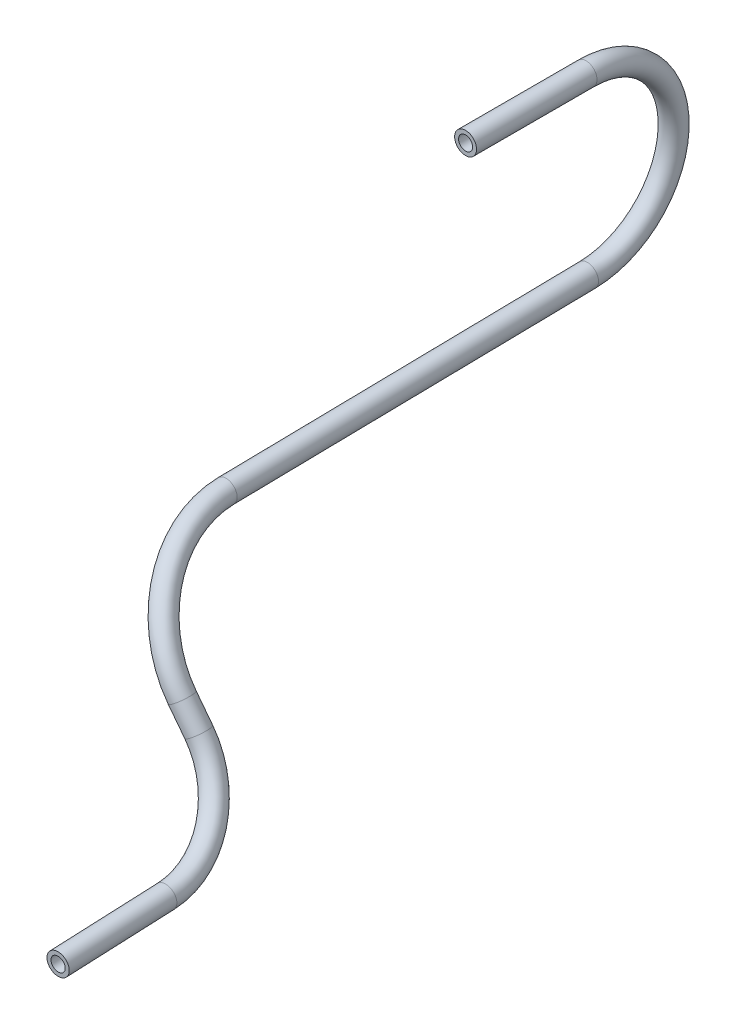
from build123d import *

# Parameters (mm, degrees)
SKETCH2_R           = 1.5875
SKETCH2_R_2         = 1.016
SKETCH5_R           = 1.5875
SKETCH5_R_2         = 1.016
REVOLVE1_ANGLE      = 91
SKETCH6_R           = 1.5875
SKETCH6_R_2         = 1.016
BOSS_EXTRUDE1_DEPTH = 3.96875
SKETCH7_R           = 1.5875
SKETCH7_R_2         = 1.016
REVOLVE2_ANGLE      = 90
SKETCH8_R           = 1.5875
SKETCH8_R_2         = 1.016
BOSS_EXTRUDE2_DEPTH = 15.875


with BuildPart() as part:
    # Sweep2: sweep along a path in Sketch1
    with BuildLine(Plane(origin=(0, 0, 0), x_dir=(0, 0, -1), z_dir=(1, 0, 0))) as sweep2_path:
        Line((-34.695375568, -26.312353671), (17.684145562, -25.398065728))
        ThreePointArc((17.684145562, -25.398065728), (30.162016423, -12.589172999), (17.4625, 0))
        Line((17.4625, 0), (0, 0))
    # Sketch2 → Sweep2 (sweep)
    with BuildSketch(Plane.XY):
        Circle(SKETCH2_R)
        Circle(SKETCH2_R_2, mode=Mode.SUBTRACT)
    sweep(path=sweep2_path.line)

    # Sketch5 → Revolve1 (revolve)
    with BuildSketch(Plane(origin=(0, -0.61343996, 35.143951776), x_dir=(1, 0, 0), z_dir=(0, -0.017452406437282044, 0.9998476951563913))):
        with Locations(Location((0, -25.702828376, 0), (0, 0, 270))):
            Circle(SKETCH5_R)
        with Locations(Location((0, -25.702828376, 0), (0, 0, 270))):
            Circle(SKETCH5_R_2, mode=Mode.SUBTRACT)
    revolve(axis=Axis((1.26090815, -44.806435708, 34.372560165), (0.8191520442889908, 0.5734890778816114, 0.010010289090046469)), revolution_arc=REVOLVE1_ANGLE)

    # Sketch6 → Boss-Extrude1 (add)
    with BuildSketch(Plane(origin=(20.823652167, -29.723668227, -1.152629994), x_dir=(0.6422133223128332, 0.47329978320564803, -0.6029505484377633), z_dir=(0.5734890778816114, -0.818597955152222, -0.03174374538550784))):
        with Locations(Location((-43.245558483, 31.879103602, 0), (0, 0, 127.677192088))):
            Circle(SKETCH6_R)
        with Locations(Location((-43.245558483, 31.879103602, 0), (0, 0, 127.677192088))):
            Circle(SKETCH6_R_2, mode=Mode.SUBTRACT)
    extrude(amount=BOSS_EXTRUDE1_DEPTH)

    # Sketch7 → Revolve2 (revolve)
    with BuildSketch(Plane(origin=(23.099686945, -32.972478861, -1.278612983), x_dir=(-0.031135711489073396, 0.016940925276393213, -0.9993715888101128), z_dir=(0.5734890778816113, -0.818597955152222, -0.03174374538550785))):
        with Locations(Location((-51.266011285, -16.070210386, 0), (0, 0, 181.478019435))):
            Circle(SKETCH7_R)
        with Locations(Location((-51.266011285, -16.070210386, 0), (0, 0, 181.478019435))):
            Circle(SKETCH7_R_2, mode=Mode.SUBTRACT)
    revolve(axis=Axis((9.826466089, -44.760026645, 62.898291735), (-0.8190400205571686, -0.573733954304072, -0.0016716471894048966)), revolution_arc=REVOLVE2_ANGLE)

    # Sketch8 → Boss-Extrude2 (add)
    with BuildSketch(Plane(origin=(1.082039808, -1.731750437, 64.206203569), x_dir=(0.9998581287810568, 0.00044829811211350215, -0.01683809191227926), z_dir=(0.01684405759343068, -0.026958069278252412, 0.9994946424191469))):
        with Locations(Location((17.958517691, -52.100956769, 0), (0, 0, 304.999916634))):
            Circle(SKETCH8_R)
        with Locations(Location((17.958517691, -52.100956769, 0), (0, 0, 304.999916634))):
            Circle(SKETCH8_R_2, mode=Mode.SUBTRACT)
    extrude(amount=BOSS_EXTRUDE2_DEPTH)


solid = part.part
